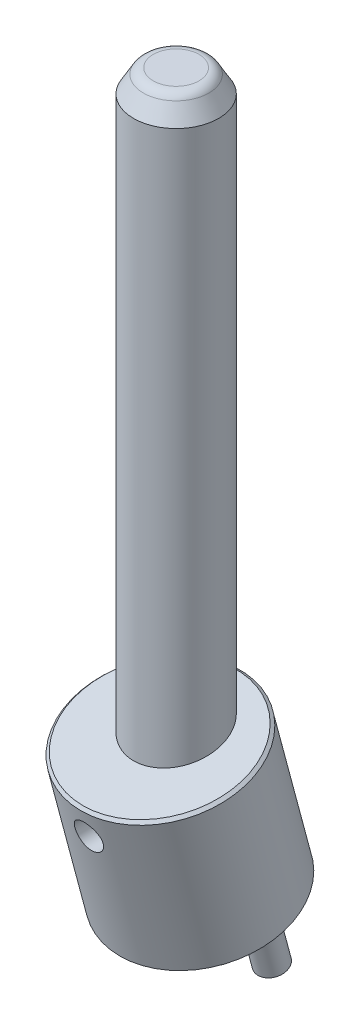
ISO-10303-21;
HEADER;
FILE_DESCRIPTION(('STEP AP214'),'2;1');
FILE_NAME('part.step','',(''),(''),'','','');
FILE_SCHEMA(('AUTOMOTIVE_DESIGN { 1 0 10303 214 1 1 1 1 }'));
ENDSEC;
DATA;
#1=APPLICATION_CONTEXT('core data for automotive mechanical design processes');
#2=APPLICATION_PROTOCOL_DEFINITION('international standard','automotive_design',2000,#1);
#3=PRODUCT_CONTEXT('',#1,'mechanical');
#4=PRODUCT('Part','Part','',(#3));
#5=PRODUCT_RELATED_PRODUCT_CATEGORY('part','',(#4));
#6=PRODUCT_DEFINITION_FORMATION('','',#4);
#7=PRODUCT_DEFINITION_CONTEXT('part definition',#1,'design');
#8=PRODUCT_DEFINITION('design','',#6,#7);
#9=PRODUCT_DEFINITION_SHAPE('','',#8);
#10=(LENGTH_UNIT() NAMED_UNIT(*) SI_UNIT(.MILLI.,.METRE.));
#11=(NAMED_UNIT(*) PLANE_ANGLE_UNIT() SI_UNIT($,.RADIAN.));
#12=(NAMED_UNIT(*) SI_UNIT($,.STERADIAN.) SOLID_ANGLE_UNIT());
#13=UNCERTAINTY_MEASURE_WITH_UNIT(LENGTH_MEASURE(1.E-05),#10,'distance_accuracy_value','');
#14=(GEOMETRIC_REPRESENTATION_CONTEXT(3) GLOBAL_UNCERTAINTY_ASSIGNED_CONTEXT((#13)) GLOBAL_UNIT_ASSIGNED_CONTEXT((#10,
#11,#12)) REPRESENTATION_CONTEXT('',''));
#15=CARTESIAN_POINT('',(0.,0.,0.));
#16=DIRECTION('',(0.,0.,1.));
#17=DIRECTION('',(1.,0.,0.));
#18=AXIS2_PLACEMENT_3D('',#15,#16,#17);
#19=CARTESIAN_POINT('',(0.,-24.1677221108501,-12.3217781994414));
#20=DIRECTION('',(0.,-0.965925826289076,-0.258819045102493));
#21=DIRECTION('',(0.,0.258819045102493,-0.965925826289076));
#22=AXIS2_PLACEMENT_3D('',#19,#20,#21);
#23=PLANE('',#22);
#24=CARTESIAN_POINT('',(-21.5,-24.1677221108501,-12.3217781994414));
#25=DIRECTION('',(0.,-0.965925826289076,-0.258819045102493));
#26=DIRECTION('',(0.,0.258819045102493,-0.965925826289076));
#27=AXIS2_PLACEMENT_3D('',#24,#25,#26);
#28=CIRCLE('',#27,4.50000075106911);
#29=CARTESIAN_POINT('',(-21.5,-23.0030362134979,-16.6684451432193));
#30=VERTEX_POINT('',#29);
#31=EDGE_CURVE('P0_E17',#30,#30,#28,.F.);
#32=ORIENTED_EDGE('',*,*,#31,.F.);
#33=EDGE_LOOP('',(#32));
#34=FACE_BOUND('',#33,.T.);
#35=ADVANCED_FACE('P0_F14',(#34),#23,.T.);
#36=CARTESIAN_POINT('',(0.,-24.1677221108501,-12.3217781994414));
#37=DIRECTION('',(0.,-0.965925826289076,-0.258819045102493));
#38=DIRECTION('',(0.,0.258819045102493,-0.965925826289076));
#39=AXIS2_PLACEMENT_3D('',#36,#37,#38);
#40=PLANE('',#39);
#41=CARTESIAN_POINT('',(21.5,-24.1677221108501,-12.3217781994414));
#42=DIRECTION('',(0.,-0.965925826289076,-0.258819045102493));
#43=DIRECTION('',(0.,0.258819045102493,-0.965925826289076));
#44=AXIS2_PLACEMENT_3D('',#41,#42,#43);
#45=CIRCLE('',#44,4.50000075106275);
#46=CARTESIAN_POINT('',(21.5,-23.0030362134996,-16.6684451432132));
#47=VERTEX_POINT('',#46);
#48=EDGE_CURVE('P0_E121',#47,#47,#45,.F.);
#49=ORIENTED_EDGE('',*,*,#48,.F.);
#50=EDGE_LOOP('',(#49));
#51=FACE_BOUND('',#50,.T.);
#52=ADVANCED_FACE('P0_F111',(#51),#40,.T.);
#53=CARTESIAN_POINT('',(0.,-1.62717062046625E-12,-9.59302082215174E-13));
#54=DIRECTION('',(0.,-1.,0.));
#55=DIRECTION('',(0.,0.,-1.));
#56=AXIS2_PLACEMENT_3D('',#53,#54,#55);
#57=PLANE('',#56);
#58=CARTESIAN_POINT('',(0.,-3.64291929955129E-13,-6.07500161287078E-12));
#59=DIRECTION('',(0.,-1.,0.));
#60=DIRECTION('',(0.,0.,-1.));
#61=AXIS2_PLACEMENT_3D('',#58,#59,#60);
#62=CIRCLE('',#61,15.);
#63=CARTESIAN_POINT('',(0.,-3.64291929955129E-13,-15.0000000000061));
#64=VERTEX_POINT('',#63);
#65=EDGE_CURVE('P0_E36',#64,#64,#62,.F.);
#66=ORIENTED_EDGE('',*,*,#65,.T.);
#67=EDGE_LOOP('',(#66));
#68=FACE_BOUND('',#67,.T.);
#69=ADVANCED_FACE('P0_F108',(#68),#57,.F.);
#70=CARTESIAN_POINT('',(-21.5,-23.6847586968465,-12.1923685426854));
#71=DIRECTION('',(0.,0.965925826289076,0.258819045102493));
#72=DIRECTION('',(0.,-0.258819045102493,0.965925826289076));
#73=AXIS2_PLACEMENT_3D('',#70,#71,#72);
#74=CONICAL_SURFACE('',#73,5.00000135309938,0.785398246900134);
#75=CARTESIAN_POINT('',(-21.5,-23.6847573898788,-12.1923681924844));
#76=DIRECTION('',(0.,-0.965925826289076,-0.258819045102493));
#77=DIRECTION('',(0.,0.258819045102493,-0.965925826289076));
#78=AXIS2_PLACEMENT_3D('',#75,#76,#77);
#79=CIRCLE('',#78,5.);
#80=CARTESIAN_POINT('',(-21.5,-22.3906621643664,-17.0219973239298));
#81=VERTEX_POINT('',#80);
#82=EDGE_CURVE('P0_E33',#81,#81,#79,.F.);
#83=ORIENTED_EDGE('',*,*,#82,.F.);
#84=EDGE_LOOP('',(#83));
#85=FACE_BOUND('',#84,.T.);
#86=ORIENTED_EDGE('',*,*,#31,.T.);
#87=EDGE_LOOP('',(#86));
#88=FACE_BOUND('',#87,.T.);
#89=ADVANCED_FACE('P0_F104',(#85,#88),#74,.T.);
#90=CARTESIAN_POINT('',(21.5,-23.6847586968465,-12.1923685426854));
#91=DIRECTION('',(0.,0.965925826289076,0.258819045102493));
#92=DIRECTION('',(0.,-0.258819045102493,0.965925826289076));
#93=AXIS2_PLACEMENT_3D('',#90,#91,#92);
#94=CONICAL_SURFACE('',#93,5.00000135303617,0.785398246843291);
#95=CARTESIAN_POINT('',(21.5,-23.6847573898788,-12.1923681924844));
#96=DIRECTION('',(0.,-0.965925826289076,-0.258819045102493));
#97=DIRECTION('',(0.,0.258819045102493,-0.965925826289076));
#98=AXIS2_PLACEMENT_3D('',#95,#96,#97);
#99=CIRCLE('',#98,5.);
#100=CARTESIAN_POINT('',(21.5,-22.3906621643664,-17.0219973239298));
#101=VERTEX_POINT('',#100);
#102=EDGE_CURVE('P0_E29',#101,#101,#99,.F.);
#103=ORIENTED_EDGE('',*,*,#102,.F.);
#104=EDGE_LOOP('',(#103));
#105=FACE_BOUND('',#104,.T.);
#106=ORIENTED_EDGE('',*,*,#48,.T.);
#107=EDGE_LOOP('',(#106));
#108=FACE_BOUND('',#107,.T.);
#109=ADVANCED_FACE('P0_F99',(#105,#108),#94,.T.);
#110=CARTESIAN_POINT('',(0.,61.8750000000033,-6.0732668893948E-12));
#111=DIRECTION('',(0.,-1.,0.));
#112=DIRECTION('',(0.,0.,-1.));
#113=AXIS2_PLACEMENT_3D('',#110,#111,#112);
#114=CYLINDRICAL_SURFACE('',#113,15.);
#115=CARTESIAN_POINT('',(0.,45.0000000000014,-6.07500161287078E-12));
#116=DIRECTION('',(0.,0.965925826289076,0.258819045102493));
#117=DIRECTION('',(0.,-0.258819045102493,0.965925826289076));
#118=AXIS2_PLACEMENT_3D('',#115,#116,#117);
#119=ELLIPSE('',#118,15.5291427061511,15.);
#120=CARTESIAN_POINT('',(0.,40.980762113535,14.9999999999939));
#121=VERTEX_POINT('',#120);
#122=EDGE_CURVE('P0_E32',#121,#121,#119,.F.);
#123=ORIENTED_EDGE('',*,*,#122,.F.);
#124=EDGE_LOOP('',(#123));
#125=FACE_BOUND('',#124,.T.);
#126=ORIENTED_EDGE('',*,*,#65,.F.);
#127=EDGE_LOOP('',(#126));
#128=FACE_BOUND('',#127,.T.);
#129=CARTESIAN_POINT('',(0.,30.9999999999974,14.9999999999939));
#130=CARTESIAN_POINT('',(-0.136274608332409,30.9999999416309,14.9999999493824));
#131=CARTESIAN_POINT('',(-0.272550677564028,30.9944241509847,14.9981386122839));
#132=CARTESIAN_POINT('',(-0.544142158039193,30.9721706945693,14.9907428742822));
#133=CARTESIAN_POINT('',(-0.679457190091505,30.9554888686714,14.9852070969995));
#134=CARTESIAN_POINT('',(-0.948257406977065,30.9111491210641,14.9706027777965));
#135=CARTESIAN_POINT('',(-1.08174007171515,30.883477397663,14.96152979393));
#136=CARTESIAN_POINT('',(-1.34580155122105,30.8174009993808,14.9400929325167));
#137=CARTESIAN_POINT('',(-1.47637921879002,30.77899216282,14.9277277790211));
#138=CARTESIAN_POINT('',(-1.7333461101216,30.6918928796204,14.9000723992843));
#139=CARTESIAN_POINT('',(-1.85974572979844,30.6432305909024,14.8847901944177));
#140=CARTESIAN_POINT('',(-2.10792399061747,30.5359631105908,14.8516789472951));
#141=CARTESIAN_POINT('',(-2.22970089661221,30.4773542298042,14.8338489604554));
#142=CARTESIAN_POINT('',(-2.58680471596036,30.2873070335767,14.7772227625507));
#143=CARTESIAN_POINT('',(-2.81420620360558,30.141545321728,14.7352562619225));
#144=CARTESIAN_POINT('',(-3.24874257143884,29.8108587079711,14.6457020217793));
#145=CARTESIAN_POINT('',(-3.45501840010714,29.6248491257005,14.5979792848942));
#146=CARTESIAN_POINT('',(-3.8341436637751,29.2211801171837,14.5030192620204));
#147=CARTESIAN_POINT('',(-4.0069839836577,29.0035120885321,14.4557821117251));
#148=CARTESIAN_POINT('',(-4.31912807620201,28.5350726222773,14.3656662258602));
#149=CARTESIAN_POINT('',(-4.45732572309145,28.2835298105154,14.3229516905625));
#150=CARTESIAN_POINT('',(-4.68909399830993,27.7591186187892,14.2487652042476));
#151=CARTESIAN_POINT('',(-4.78267844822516,27.4862568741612,14.2172897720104));
#152=CARTESIAN_POINT('',(-4.91936749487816,26.9366338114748,14.1705651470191));
#153=CARTESIAN_POINT('',(-4.96406724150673,26.6603139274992,14.1548047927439));
#154=CARTESIAN_POINT('',(-5.00670561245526,26.1036813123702,14.1397828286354));
#155=CARTESIAN_POINT('',(-5.00465868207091,25.8233698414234,14.1405161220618));
#156=CARTESIAN_POINT('',(-4.95509941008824,25.2803173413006,14.157950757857));
#157=CARTESIAN_POINT('',(-4.90966912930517,25.0173587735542,14.1739208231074));
#158=CARTESIAN_POINT('',(-4.77803186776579,24.503034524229,14.2188326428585));
#159=CARTESIAN_POINT('',(-4.69181981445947,24.2516702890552,14.2477760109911));
#160=CARTESIAN_POINT('',(-4.47968995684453,23.762927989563,14.3158968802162));
#161=CARTESIAN_POINT('',(-4.3531541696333,23.5258408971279,14.3552319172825));
#162=CARTESIAN_POINT('',(-4.06444611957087,23.0756402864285,14.4396288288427));
#163=CARTESIAN_POINT('',(-3.90226546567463,22.8625324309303,14.4846920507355));
#164=CARTESIAN_POINT('',(-3.53674216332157,22.4545530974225,14.5783642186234));
#165=CARTESIAN_POINT('',(-3.33169626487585,22.2612084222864,14.6270356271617));
#166=CARTESIAN_POINT('',(-3.00176707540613,21.9988448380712,14.6970107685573));
#167=CARTESIAN_POINT('',(-2.88796886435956,21.9159467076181,14.7198467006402));
#168=CARTESIAN_POINT('',(-2.65358317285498,21.7599196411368,14.7638979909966));
#169=CARTESIAN_POINT('',(-2.53299841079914,21.6867868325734,14.7851139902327));
#170=CARTESIAN_POINT('',(-2.2844294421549,21.5500863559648,14.8255663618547));
#171=CARTESIAN_POINT('',(-2.15637801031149,21.4866337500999,14.8447781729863));
#172=CARTESIAN_POINT('',(-1.89503347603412,21.3708247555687,14.8803974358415));
#173=CARTESIAN_POINT('',(-1.76174256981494,21.3184637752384,14.8968060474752));
#174=CARTESIAN_POINT('',(-1.49104566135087,21.2253547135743,14.9263287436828));
#175=CARTESIAN_POINT('',(-1.35364649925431,21.1845884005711,14.9394479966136));
#176=CARTESIAN_POINT('',(-1.07562722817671,21.1149668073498,14.9620340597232));
#177=CARTESIAN_POINT('',(-0.935008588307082,21.0861062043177,14.9715025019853));
#178=CARTESIAN_POINT('',(-0.66233031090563,21.0422867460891,14.9859443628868));
#179=CARTESIAN_POINT('',(-0.530427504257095,21.0264417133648,14.9912035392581));
#180=CARTESIAN_POINT('',(-0.265683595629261,21.0052983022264,14.9982313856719));
#181=CARTESIAN_POINT('',(-0.132842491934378,20.9999999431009,15.0000000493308));
#182=CARTESIAN_POINT('',(0.136274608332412,21.0000000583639,14.9999999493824));
#183=CARTESIAN_POINT('',(0.272550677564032,21.0055758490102,14.9981386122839));
#184=CARTESIAN_POINT('',(0.544142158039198,21.0278293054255,14.9907428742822));
#185=CARTESIAN_POINT('',(0.67945719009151,21.0445111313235,14.9852070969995));
#186=CARTESIAN_POINT('',(0.94825740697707,21.0888508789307,14.9706027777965));
#187=CARTESIAN_POINT('',(1.08174007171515,21.1165226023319,14.96152979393));
#188=CARTESIAN_POINT('',(1.34580155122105,21.182599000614,14.9400929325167));
#189=CARTESIAN_POINT('',(1.47637921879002,21.2210078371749,14.9277277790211));
#190=CARTESIAN_POINT('',(1.7333461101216,21.3081071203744,14.9000723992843));
#191=CARTESIAN_POINT('',(1.85974572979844,21.3567694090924,14.8847901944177));
#192=CARTESIAN_POINT('',(2.10792399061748,21.464036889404,14.8516789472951));
#193=CARTESIAN_POINT('',(2.22970089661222,21.5226457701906,14.8338489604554));
#194=CARTESIAN_POINT('',(2.58680471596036,21.7126929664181,14.7772227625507));
#195=CARTESIAN_POINT('',(2.81420620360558,21.8584546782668,14.7352562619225));
#196=CARTESIAN_POINT('',(3.24874257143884,22.1891412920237,14.6457020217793));
#197=CARTESIAN_POINT('',(3.45501840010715,22.3751508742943,14.5979792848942));
#198=CARTESIAN_POINT('',(3.8341436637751,22.7788198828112,14.5030192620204));
#199=CARTESIAN_POINT('',(4.0069839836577,22.9964879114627,14.4557821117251));
#200=CARTESIAN_POINT('',(4.31912807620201,23.4649273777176,14.3656662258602));
#201=CARTESIAN_POINT('',(4.45732572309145,23.7164701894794,14.3229516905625));
#202=CARTESIAN_POINT('',(4.68909399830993,24.2408813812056,14.2487652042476));
#203=CARTESIAN_POINT('',(4.78267844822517,24.5137431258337,14.2172897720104));
#204=CARTESIAN_POINT('',(4.91936749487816,25.06336618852,14.1705651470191));
#205=CARTESIAN_POINT('',(4.96406724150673,25.3396860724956,14.1548047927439));
#206=CARTESIAN_POINT('',(5.00670561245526,25.8963186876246,14.1397828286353));
#207=CARTESIAN_POINT('',(5.00465868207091,26.1766301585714,14.1405161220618));
#208=CARTESIAN_POINT('',(4.95509941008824,26.7196826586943,14.157950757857));
#209=CARTESIAN_POINT('',(4.90966912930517,26.9826412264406,14.1739208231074));
#210=CARTESIAN_POINT('',(4.77803186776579,27.4969654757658,14.2188326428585));
#211=CARTESIAN_POINT('',(4.69181981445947,27.7483297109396,14.2477760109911));
#212=CARTESIAN_POINT('',(4.47968995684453,28.2370720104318,14.3158968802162));
#213=CARTESIAN_POINT('',(4.35315416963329,28.4741591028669,14.3552319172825));
#214=CARTESIAN_POINT('',(4.06444611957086,28.9243597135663,14.4396288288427));
#215=CARTESIAN_POINT('',(3.90226546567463,29.1374675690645,14.4846920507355));
#216=CARTESIAN_POINT('',(3.53674216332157,29.5454469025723,14.5783642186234));
#217=CARTESIAN_POINT('',(3.33169626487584,29.7387915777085,14.6270356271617));
#218=CARTESIAN_POINT('',(3.00176707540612,30.0011551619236,14.6970107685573));
#219=CARTESIAN_POINT('',(2.88796886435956,30.0840532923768,14.7198467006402));
#220=CARTESIAN_POINT('',(2.65358317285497,30.240080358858,14.7638979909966));
#221=CARTESIAN_POINT('',(2.53299841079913,30.3132131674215,14.7851139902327));
#222=CARTESIAN_POINT('',(2.28442944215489,30.44991364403,14.8255663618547));
#223=CARTESIAN_POINT('',(2.15637801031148,30.5133662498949,14.8447781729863));
#224=CARTESIAN_POINT('',(1.89503347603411,30.6291752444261,14.8803974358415));
#225=CARTESIAN_POINT('',(1.76174256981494,30.6815362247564,14.8968060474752));
#226=CARTESIAN_POINT('',(1.49104566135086,30.7746452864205,14.9263287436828));
#227=CARTESIAN_POINT('',(1.3536464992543,30.8154115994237,14.9394479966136));
#228=CARTESIAN_POINT('',(1.0756272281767,30.885033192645,14.9620340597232));
#229=CARTESIAN_POINT('',(0.935008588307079,30.9138937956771,14.9715025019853));
#230=CARTESIAN_POINT('',(0.662330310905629,30.9577132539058,14.9859443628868));
#231=CARTESIAN_POINT('',(0.530427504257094,30.97355828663,14.9912035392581));
#232=CARTESIAN_POINT('',(0.26568359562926,30.9947016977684,14.9982313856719));
#233=CARTESIAN_POINT('',(0.132842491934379,31.000000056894,15.0000000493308));
#234=CARTESIAN_POINT('',(0.,30.9999999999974,14.9999999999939));
#235=B_SPLINE_CURVE_WITH_KNOTS('',3,(#129,#130,#131,#132,#133,#134,#135,#136,#137,#138,#139,
#140,#141,#142,#143,#144,#145,#146,#147,#148,#149,#150,#151,#152,#153,#154,#155,#156,#157,#158,
#159,#160,#161,#162,#163,#164,#165,#166,#167,#168,#169,#170,#171,#172,#173,#174,#175,#176,#177,
#178,#179,#180,#181,#182,#183,#184,#185,#186,#187,#188,#189,#190,#191,#192,#193,#194,#195,#196,
#197,#198,#199,#200,#201,#202,#203,#204,#205,#206,#207,#208,#209,#210,#211,#212,#213,#214,#215,
#216,#217,#218,#219,#220,#221,#222,#223,#224,#225,#226,#227,#228,#229,#230,#231,#232,#233,#234),
.UNSPECIFIED.,.T.,.F.,(4,2,2,2,2,2,2,2,2,2,2,2,2,2,2,2,2,2,2,2,2,2,2,2,2,2,2,2,2,2,2,2,2,2,2,2,
2,2,2,2,2,2,2,2,2,2,2,2,2,2,2,2,4),(0.,0.408700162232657,0.81755350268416,1.22692193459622,
1.63644925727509,2.04486626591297,2.45343508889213,3.26962321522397,4.11140352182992,
4.9534129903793,5.81961254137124,6.68554356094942,7.52228757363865,8.3587730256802,
9.15703078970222,9.95538786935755,10.7666215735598,11.5780464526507,12.4317109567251,
12.8591940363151,13.286507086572,13.7185586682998,14.150431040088,14.5816205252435,
15.0126170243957,15.4110232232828,15.8094301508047,16.2181303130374,16.6269836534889,
17.0363520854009,17.4458794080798,17.8542964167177,18.2628652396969,19.0790533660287,
19.9208336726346,20.762843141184,21.629042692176,22.4949737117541,23.3317177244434,
24.1682031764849,24.9664609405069,25.7648180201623,26.5760517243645,27.3874766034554,
28.2411411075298,28.6686241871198,29.0959372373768,29.5279888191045,29.9598611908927,
30.3910506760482,30.8220471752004,31.2204533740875,31.6188603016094),.UNSPECIFIED.);
#236=CARTESIAN_POINT('',(0.,30.9999999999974,14.9999999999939));
#237=VERTEX_POINT('',#236);
#238=EDGE_CURVE('P0_E84',#237,#237,#235,.T.);
#239=ORIENTED_EDGE('',*,*,#238,.T.);
#240=EDGE_LOOP('',(#239));
#241=FACE_BOUND('',#240,.T.);
#242=ADVANCED_FACE('P0_F93',(#125,#128,#241),#114,.F.);
#243=CARTESIAN_POINT('',(-21.5,-9.678834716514,-8.439492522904));
#244=DIRECTION('',(0.,-0.965925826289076,-0.258819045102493));
#245=DIRECTION('',(0.,0.258819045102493,-0.965925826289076));
#246=AXIS2_PLACEMENT_3D('',#243,#244,#245);
#247=CYLINDRICAL_SURFACE('',#246,5.);
#248=CARTESIAN_POINT('',(-21.5,-9.678834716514,-8.439492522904));
#249=DIRECTION('',(0.,-0.965925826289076,-0.258819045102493));
#250=DIRECTION('',(0.,0.258819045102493,-0.965925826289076));
#251=AXIS2_PLACEMENT_3D('',#248,#249,#250);
#252=CIRCLE('',#251,5.);
#253=CARTESIAN_POINT('',(-21.5,-8.38473949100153,-13.2691216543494));
#254=VERTEX_POINT('',#253);
#255=EDGE_CURVE('P0_E80',#254,#254,#252,.T.);
#256=ORIENTED_EDGE('',*,*,#255,.T.);
#257=EDGE_LOOP('',(#256));
#258=FACE_BOUND('',#257,.T.);
#259=ORIENTED_EDGE('',*,*,#82,.T.);
#260=EDGE_LOOP('',(#259));
#261=FACE_BOUND('',#260,.T.);
#262=ADVANCED_FACE('P0_F98',(#258,#261),#247,.T.);
#263=CARTESIAN_POINT('',(21.5,-9.678834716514,-8.439492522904));
#264=DIRECTION('',(0.,-0.965925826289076,-0.258819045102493));
#265=DIRECTION('',(0.,0.258819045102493,-0.965925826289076));
#266=AXIS2_PLACEMENT_3D('',#263,#264,#265);
#267=CYLINDRICAL_SURFACE('',#266,5.);
#268=CARTESIAN_POINT('',(21.5,-9.678834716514,-8.439492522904));
#269=DIRECTION('',(0.,-0.965925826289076,-0.258819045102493));
#270=DIRECTION('',(0.,0.258819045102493,-0.965925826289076));
#271=AXIS2_PLACEMENT_3D('',#268,#269,#270);
#272=CIRCLE('',#271,5.);
#273=CARTESIAN_POINT('',(21.5,-8.38473949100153,-13.2691216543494));
#274=VERTEX_POINT('',#273);
#275=EDGE_CURVE('P0_E76',#274,#274,#272,.T.);
#276=ORIENTED_EDGE('',*,*,#275,.T.);
#277=EDGE_LOOP('',(#276));
#278=FACE_BOUND('',#277,.T.);
#279=ORIENTED_EDGE('',*,*,#102,.T.);
#280=EDGE_LOOP('',(#279));
#281=FACE_BOUND('',#280,.T.);
#282=ADVANCED_FACE('P0_F178',(#278,#281),#267,.T.);
#283=CARTESIAN_POINT('',(0.,43.4470857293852,5.79555495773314));
#284=DIRECTION('',(0.,0.965925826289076,0.258819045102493));
#285=DIRECTION('',(0.,-0.258819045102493,0.965925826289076));
#286=AXIS2_PLACEMENT_3D('',#283,#284,#285);
#287=PLANE('',#286);
#288=ORIENTED_EDGE('',*,*,#122,.T.);
#289=EDGE_LOOP('',(#288));
#290=FACE_BOUND('',#289,.T.);
#291=CARTESIAN_POINT('',(0.,43.4470857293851,5.79555495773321));
#292=DIRECTION('',(0.,0.965925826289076,0.258819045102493));
#293=DIRECTION('',(0.,-0.258819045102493,0.965925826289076));
#294=AXIS2_PLACEMENT_3D('',#291,#292,#293);
#295=CIRCLE('',#294,27.9999945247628);
#296=CARTESIAN_POINT('',(0.,36.200153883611,32.8414728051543));
#297=VERTEX_POINT('',#296);
#298=EDGE_CURVE('P0_E46',#297,#297,#295,.F.);
#299=ORIENTED_EDGE('',*,*,#298,.F.);
#300=EDGE_LOOP('',(#299));
#301=FACE_BOUND('',#300,.T.);
#302=ADVANCED_FACE('P0_F71',(#290,#301),#287,.T.);
#303=CARTESIAN_POINT('',(0.,25.9999999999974,-7.09102540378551));
#304=DIRECTION('',(0.,0.,1.));
#305=DIRECTION('',(0.,-1.,0.));
#306=AXIS2_PLACEMENT_3D('',#303,#304,#305);
#307=CYLINDRICAL_SURFACE('',#306,5.);
#308=ORIENTED_EDGE('',*,*,#238,.F.);
#309=EDGE_LOOP('',(#308));
#310=FACE_BOUND('',#309,.T.);
#311=CARTESIAN_POINT('',(0.,20.9999999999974,29.8038856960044));
#312=CARTESIAN_POINT('',(-0.13972339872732,21.0000005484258,29.8038855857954));
#313=CARTESIAN_POINT('',(-0.279460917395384,21.0058611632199,29.8044081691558));
#314=CARTESIAN_POINT('',(-0.557998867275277,21.0292674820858,29.806516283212));
#315=CARTESIAN_POINT('',(-0.696798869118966,21.0468182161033,29.8081022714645));
#316=CARTESIAN_POINT('',(-0.972634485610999,21.0935168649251,29.8123931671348));
#317=CARTESIAN_POINT('',(-1.10966711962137,21.1226822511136,29.8150997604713));
#318=CARTESIAN_POINT('',(-1.38082596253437,21.1924096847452,29.8217181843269));
#319=CARTESIAN_POINT('',(-1.51495106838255,21.2329759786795,29.8256304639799));
#320=CARTESIAN_POINT('',(-1.77914869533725,21.325154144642,29.8347694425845));
#321=CARTESIAN_POINT('',(-1.90922526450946,21.3767545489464,29.8399947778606));
#322=CARTESIAN_POINT('',(-2.16459019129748,21.4906648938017,29.8519021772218));
#323=CARTESIAN_POINT('',(-2.28987676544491,21.5529787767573,29.8585847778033));
#324=CARTESIAN_POINT('',(-2.53461764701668,21.687783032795,29.8735559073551));
#325=CARTESIAN_POINT('',(-2.6540765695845,21.7602651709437,29.8818431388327));
#326=CARTESIAN_POINT('',(-2.88646225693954,21.9149267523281,29.9001971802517));
#327=CARTESIAN_POINT('',(-2.99938660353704,21.997109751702,29.9102646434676));
#328=CARTESIAN_POINT('',(-3.21766362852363,22.1703755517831,29.9323274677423));
#329=CARTESIAN_POINT('',(-3.32302914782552,22.2614426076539,29.9443194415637));
#330=CARTESIAN_POINT('',(-3.52570347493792,22.4519353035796,29.9704111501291));
#331=CARTESIAN_POINT('',(-3.62300930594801,22.5513640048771,29.9845116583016));
#332=CARTESIAN_POINT('',(-3.80881768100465,22.7577505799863,30.0149594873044));
#333=CARTESIAN_POINT('',(-3.89732320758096,22.8647058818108,30.0313060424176));
#334=CARTESIAN_POINT('',(-4.06500511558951,23.0853910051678,30.0663791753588));
#335=CARTESIAN_POINT('',(-4.14417804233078,23.1991233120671,30.0851066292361));
#336=CARTESIAN_POINT('',(-4.29260666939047,23.4323886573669,30.1250172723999));
#337=CARTESIAN_POINT('',(-4.3618676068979,23.5519185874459,30.1461991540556));
#338=CARTESIAN_POINT('',(-4.49012594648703,23.795962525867,30.191084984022));
#339=CARTESIAN_POINT('',(-4.54911959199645,23.9204783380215,30.2147898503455));
#340=CARTESIAN_POINT('',(-4.65646769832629,24.1734798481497,30.2647162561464));
#341=CARTESIAN_POINT('',(-4.70482596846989,24.3019641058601,30.2909368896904));
#342=CARTESIAN_POINT('',(-4.7907144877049,24.5620015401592,30.345856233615));
#343=CARTESIAN_POINT('',(-4.82824067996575,24.6935558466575,30.3745558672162));
#344=CARTESIAN_POINT('',(-4.9251640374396,25.0949878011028,30.4650671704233));
#345=CARTESIAN_POINT('',(-4.96751571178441,25.3683436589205,30.5306487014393));
#346=CARTESIAN_POINT('',(-5.00684198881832,25.9159828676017,30.670278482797));
#347=CARTESIAN_POINT('',(-5.00380830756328,26.1902663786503,30.7443282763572));
#348=CARTESIAN_POINT('',(-4.9525769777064,26.7427318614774,30.9016043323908));
#349=CARTESIAN_POINT('',(-4.90275255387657,27.0206970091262,30.9850653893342));
#350=CARTESIAN_POINT('',(-4.75763334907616,27.5632813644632,31.1558257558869));
#351=CARTESIAN_POINT('',(-4.66232603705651,27.8278968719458,31.2431261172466));
#352=CARTESIAN_POINT('',(-4.42417180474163,28.3477094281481,31.4215393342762));
#353=CARTESIAN_POINT('',(-4.27955964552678,28.6020939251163,31.5126637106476));
#354=CARTESIAN_POINT('',(-3.94726004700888,29.0829247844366,31.6907915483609));
#355=CARTESIAN_POINT('',(-3.75956927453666,29.3093689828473,31.7777946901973));
#356=CARTESIAN_POINT('',(-3.44904009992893,29.6229690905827,31.9015067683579));
#357=CARTESIAN_POINT('',(-3.34053366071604,29.7232746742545,31.9416611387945));
#358=CARTESIAN_POINT('',(-3.11446793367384,29.9143266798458,32.0190627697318));
#359=CARTESIAN_POINT('',(-2.99691245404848,30.0050770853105,32.0563112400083));
#360=CARTESIAN_POINT('',(-2.75341819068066,30.1762246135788,32.1272865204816));
#361=CARTESIAN_POINT('',(-2.62747584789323,30.2566172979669,32.1610118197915));
#362=CARTESIAN_POINT('',(-2.36810773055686,30.4061850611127,32.2243018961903));
#363=CARTESIAN_POINT('',(-2.23468277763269,30.4753613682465,32.2538671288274));
#364=CARTESIAN_POINT('',(-1.96949551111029,30.5979492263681,32.3066285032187));
#365=CARTESIAN_POINT('',(-1.83810850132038,30.6520548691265,32.330099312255));
#366=CARTESIAN_POINT('',(-1.57054560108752,30.7490661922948,32.3724006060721));
#367=CARTESIAN_POINT('',(-1.43437028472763,30.7919732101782,32.3912316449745));
#368=CARTESIAN_POINT('',(-1.1586344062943,30.8659938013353,32.4238387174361));
#369=CARTESIAN_POINT('',(-1.01908324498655,30.8971368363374,32.4376273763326));
#370=CARTESIAN_POINT('',(-0.737481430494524,30.9473784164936,32.4599219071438));
#371=CARTESIAN_POINT('',(-0.595432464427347,30.9664847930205,32.4684312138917));
#372=CARTESIAN_POINT('',(-0.377537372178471,30.9862989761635,32.4772634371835));
#373=CARTESIAN_POINT('',(-0.302144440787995,30.9914345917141,32.4795547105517));
#374=CARTESIAN_POINT('',(-0.15117081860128,30.99828538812,32.4826119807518));
#375=CARTESIAN_POINT('',(-0.0755901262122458,31.0000005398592,32.4833779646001));
#376=CARTESIAN_POINT('',(0.132241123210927,30.9999990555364,32.4833770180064));
#377=CARTESIAN_POINT('',(0.26451111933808,30.9947471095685,32.4810310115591));
#378=CARTESIAN_POINT('',(0.528109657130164,30.9737910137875,32.47168680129));
#379=CARTESIAN_POINT('',(0.659437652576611,30.9580812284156,32.4646860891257));
#380=CARTESIAN_POINT('',(0.920360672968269,30.9163421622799,32.4461426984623));
#381=CARTESIAN_POINT('',(1.04995219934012,30.8902945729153,32.4345919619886));
#382=CARTESIAN_POINT('',(1.30628180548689,30.8281498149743,32.4071511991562));
#383=CARTESIAN_POINT('',(1.43301871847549,30.7920486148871,32.3912594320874));
#384=CARTESIAN_POINT('',(1.68229560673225,30.7103098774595,32.355473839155));
#385=CARTESIAN_POINT('',(1.80484882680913,30.6647064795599,32.3355943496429));
#386=CARTESIAN_POINT('',(2.04547386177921,30.5643246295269,32.2921243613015));
#387=CARTESIAN_POINT('',(2.16354398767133,30.509542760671,32.2685324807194));
#388=CARTESIAN_POINT('',(2.5097906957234,30.3322099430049,32.1927542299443));
#389=CARTESIAN_POINT('',(2.7303310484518,30.1965633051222,32.1355169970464));
#390=CARTESIAN_POINT('',(3.15497128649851,29.8881970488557,32.0081261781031));
#391=CARTESIAN_POINT('',(3.35794293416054,29.7141244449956,31.9375199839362));
#392=CARTESIAN_POINT('',(3.73244900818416,29.3375662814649,31.788867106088));
#393=CARTESIAN_POINT('',(3.90397056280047,29.1350691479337,31.710817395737));
#394=CARTESIAN_POINT('',(4.22430277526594,28.6900140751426,31.5446989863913));
#395=CARTESIAN_POINT('',(4.37033093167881,28.4455690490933,31.4563222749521));
#396=CARTESIAN_POINT('',(4.61895193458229,27.9353890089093,31.2792437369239));
#397=CARTESIAN_POINT('',(4.72153343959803,27.6696484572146,31.1905418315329));
#398=CARTESIAN_POINT('',(4.84207312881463,27.2554218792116,31.0585970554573));
#399=CARTESIAN_POINT('',(4.8769949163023,27.1120857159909,31.0140299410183));
#400=CARTESIAN_POINT('',(4.9340905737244,26.8224947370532,30.9262901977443));
#401=CARTESIAN_POINT('',(4.95626920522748,26.6762410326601,30.8831170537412));
#402=CARTESIAN_POINT('',(4.98760238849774,26.3817843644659,30.7985724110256));
#403=CARTESIAN_POINT('',(4.99675272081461,26.2335807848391,30.7572015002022));
#404=CARTESIAN_POINT('',(5.00180228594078,25.9364127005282,30.6766607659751));
#405=CARTESIAN_POINT('',(4.99770727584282,25.7874485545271,30.6374899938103));
#406=CARTESIAN_POINT('',(4.9763716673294,25.4929966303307,30.5624475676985));
#407=CARTESIAN_POINT('',(4.95941068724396,25.3475019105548,30.5265236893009));
#408=CARTESIAN_POINT('',(4.91265168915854,25.0580124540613,30.4573167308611));
#409=CARTESIAN_POINT('',(4.88285887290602,24.9140171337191,30.424032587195));
#410=CARTESIAN_POINT('',(4.81051141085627,24.6286321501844,30.3602601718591));
#411=CARTESIAN_POINT('',(4.76795664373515,24.4872425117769,30.3297719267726));
#412=CARTESIAN_POINT('',(4.67028030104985,24.2082630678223,30.2716972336));
#413=CARTESIAN_POINT('',(4.61515948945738,24.0706730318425,30.2441106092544));
#414=CARTESIAN_POINT('',(4.49533539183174,23.8063517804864,30.1930104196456));
#415=CARTESIAN_POINT('',(4.43115260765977,23.6794085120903,30.1693719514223));
#416=CARTESIAN_POINT('',(4.29197465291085,23.4311077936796,30.124759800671));
#417=CARTESIAN_POINT('',(4.21698000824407,23.3097500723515,30.1037859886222));
#418=CARTESIAN_POINT('',(4.05667114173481,23.0736053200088,30.0644303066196));
#419=CARTESIAN_POINT('',(3.97135677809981,22.9588183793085,30.046048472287));
#420=CARTESIAN_POINT('',(3.79103909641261,22.7368013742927,30.0117697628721));
#421=CARTESIAN_POINT('',(3.69603961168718,22.6295683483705,29.9958719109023));
#422=CARTESIAN_POINT('',(3.49959428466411,22.4261630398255,29.966787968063));
#423=CARTESIAN_POINT('',(3.39837940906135,22.3297760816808,29.9535422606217));
#424=CARTESIAN_POINT('',(3.18813345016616,22.1457406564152,29.9291086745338));
#425=CARTESIAN_POINT('',(3.07910544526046,22.0580887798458,29.9179199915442));
#426=CARTESIAN_POINT('',(2.85388687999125,21.8920912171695,29.8974180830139));
#427=CARTESIAN_POINT('',(2.73769092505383,21.8137526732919,29.888106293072));
#428=CARTESIAN_POINT('',(2.49908649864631,21.6670829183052,29.8712008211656));
#429=CARTESIAN_POINT('',(2.37668032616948,21.5987480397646,29.8636065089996));
#430=CARTESIAN_POINT('',(2.12696855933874,21.4728060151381,29.8499929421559));
#431=CARTESIAN_POINT('',(1.99968328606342,21.4151592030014,29.8439678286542));
#432=CARTESIAN_POINT('',(1.74073326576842,21.3107217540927,29.83330841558));
#433=CARTESIAN_POINT('',(1.60907018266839,21.263927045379,29.8286735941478));
#434=CARTESIAN_POINT('',(1.34245723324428,21.1815721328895,29.8206700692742));
#435=CARTESIAN_POINT('',(1.20751258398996,21.1459952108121,29.8172994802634));
#436=CARTESIAN_POINT('',(0.935150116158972,21.0862518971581,29.8117145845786));
#437=CARTESIAN_POINT('',(0.797733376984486,21.0620806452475,29.8094997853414));
#438=CARTESIAN_POINT('',(0.550270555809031,21.0291488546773,29.8065043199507));
#439=CARTESIAN_POINT('',(0.440509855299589,21.0182227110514,29.8055206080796));
#440=CARTESIAN_POINT('',(0.220502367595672,21.003648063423,29.8042113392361));
#441=CARTESIAN_POINT('',(0.1102555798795,20.9999995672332,29.8038857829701));
#442=CARTESIAN_POINT('',(0.,20.9999999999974,29.8038856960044));
#443=B_SPLINE_CURVE_WITH_KNOTS('',3,(#311,#312,#313,#314,#315,#316,#317,#318,#319,#320,#321,
#322,#323,#324,#325,#326,#327,#328,#329,#330,#331,#332,#333,#334,#335,#336,#337,#338,#339,#340,
#341,#342,#343,#344,#345,#346,#347,#348,#349,#350,#351,#352,#353,#354,#355,#356,#357,#358,#359,
#360,#361,#362,#363,#364,#365,#366,#367,#368,#369,#370,#371,#372,#373,#374,#375,#376,#377,#378,
#379,#380,#381,#382,#383,#384,#385,#386,#387,#388,#389,#390,#391,#392,#393,#394,#395,#396,#397,
#398,#399,#400,#401,#402,#403,#404,#405,#406,#407,#408,#409,#410,#411,#412,#413,#414,#415,#416,
#417,#418,#419,#420,#421,#422,#423,#424,#425,#426,#427,#428,#429,#430,#431,#432,#433,#434,#435,
#436,#437,#438,#439,#440,#441,#442),.UNSPECIFIED.,.T.,.F.,(4,2,2,2,2,2,2,2,2,2,2,2,2,2,2,2,2,2,
2,2,2,2,2,2,2,2,2,2,2,2,2,2,2,2,2,2,2,2,2,2,2,2,2,2,2,2,2,2,2,2,2,2,2,2,2,2,2,2,2,2,2,2,2,2,2,
4),(0.,0.41907102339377,0.838322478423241,1.25820699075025,1.67824810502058,2.09785477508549,
2.51761618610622,2.93703958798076,3.35661722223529,3.7754643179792,4.19446542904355,
4.61332404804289,5.03233723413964,5.45112820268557,5.87007207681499,6.28886565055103,
6.70781586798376,7.55647362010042,8.40528627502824,9.28474691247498,10.1644499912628,
11.0796973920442,11.9950156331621,12.4539033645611,12.9125990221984,13.371490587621,
13.8303318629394,14.2618116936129,14.6932399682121,15.1235804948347,15.5536407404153,
15.7803666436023,16.0070944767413,16.4037434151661,16.8006062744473,17.19817515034,
17.5959036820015,17.9922271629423,18.3886985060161,19.1806086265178,20.0068725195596,
20.8334738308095,21.7240059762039,22.6147704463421,23.0766444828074,23.5383458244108,
24.0001966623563,24.4618467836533,24.9137414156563,25.3654530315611,25.8171689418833,
26.2688573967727,26.7009174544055,27.1329565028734,27.5650014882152,27.9968761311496,
28.4175546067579,28.8380682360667,29.2589022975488,29.6795816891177,30.0986671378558,
30.5175950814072,30.9358956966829,31.3540178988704,31.6847060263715,32.0153945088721),.UNSPECIFIED.);
#444=CARTESIAN_POINT('',(0.,20.9999999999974,29.8038856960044));
#445=VERTEX_POINT('',#444);
#446=EDGE_CURVE('P0_E39',#445,#445,#443,.T.);
#447=ORIENTED_EDGE('',*,*,#446,.F.);
#448=EDGE_LOOP('',(#447));
#449=FACE_BOUND('',#448,.T.);
#450=ADVANCED_FACE('P0_F48',(#310,#449),#307,.F.);
#451=CARTESIAN_POINT('',(0.,-9.678834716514,-8.439492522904));
#452=DIRECTION('',(0.,0.965925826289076,0.258819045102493));
#453=DIRECTION('',(0.,-0.258819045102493,0.965925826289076));
#454=AXIS2_PLACEMENT_3D('',#451,#452,#453);
#455=PLANE('',#454);
#456=ORIENTED_EDGE('',*,*,#275,.F.);
#457=EDGE_LOOP('',(#456));
#458=FACE_BOUND('',#457,.T.);
#459=ORIENTED_EDGE('',*,*,#255,.F.);
#460=EDGE_LOOP('',(#459));
#461=FACE_BOUND('',#460,.T.);
#462=CARTESIAN_POINT('',(-1.28369537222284E-13,-9.67883471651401,-8.43949252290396));
#463=DIRECTION('',(0.,0.965925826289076,0.258819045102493));
#464=DIRECTION('',(0.,-0.258819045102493,0.965925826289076));
#465=AXIS2_PLACEMENT_3D('',#462,#463,#464);
#466=CIRCLE('',#465,27.9999942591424);
#467=CARTESIAN_POINT('',(-1.28369537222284E-13,-16.9257664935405,18.6064250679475));
#468=VERTEX_POINT('',#467);
#469=EDGE_CURVE('P0_E26',#468,#468,#466,.T.);
#470=ORIENTED_EDGE('',*,*,#469,.F.);
#471=EDGE_LOOP('',(#470));
#472=FACE_BOUND('',#471,.T.);
#473=ADVANCED_FACE('P0_F63',(#458,#461,#472),#455,.F.);
#474=CARTESIAN_POINT('',(0.,42.4811570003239,5.53673513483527));
#475=DIRECTION('',(0.,-0.965925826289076,-0.258819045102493));
#476=DIRECTION('',(0.,0.258819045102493,-0.965925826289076));
#477=AXIS2_PLACEMENT_3D('',#474,#475,#476);
#478=CONICAL_SURFACE('',#477,28.9999973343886,0.785398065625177);
#479=ORIENTED_EDGE('',*,*,#298,.T.);
#480=EDGE_LOOP('',(#479));
#481=FACE_BOUND('',#480,.T.);
#482=CARTESIAN_POINT('',(0.,42.4811595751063,5.53673582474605));
#483=DIRECTION('',(0.,0.965925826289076,0.258819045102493));
#484=DIRECTION('',(0.,-0.258819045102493,0.965925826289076));
#485=AXIS2_PLACEMENT_3D('',#482,#483,#484);
#486=CIRCLE('',#485,29.);
#487=CARTESIAN_POINT('',(0.,34.975407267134,33.5485847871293));
#488=VERTEX_POINT('',#487);
#489=EDGE_CURVE('P0_E21',#488,#488,#486,.F.);
#490=ORIENTED_EDGE('',*,*,#489,.F.);
#491=EDGE_LOOP('',(#490));
#492=FACE_BOUND('',#491,.T.);
#493=ADVANCED_FACE('P0_F60',(#481,#492),#478,.T.);
#494=CARTESIAN_POINT('',(-1.28369537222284E-13,-8.71290581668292,-8.18067265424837));
#495=DIRECTION('',(0.,0.965925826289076,0.258819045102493));
#496=DIRECTION('',(0.,-0.258819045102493,0.965925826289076));
#497=AXIS2_PLACEMENT_3D('',#494,#495,#496);
#498=CONICAL_SURFACE('',#497,28.9999972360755,0.785398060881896);
#499=CARTESIAN_POINT('',(0.,-8.71290848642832,-8.18067336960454));
#500=DIRECTION('',(0.,0.965925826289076,0.258819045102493));
#501=DIRECTION('',(0.,-0.258819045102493,0.965925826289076));
#502=AXIS2_PLACEMENT_3D('',#499,#500,#501);
#503=CIRCLE('',#502,29.);
#504=CARTESIAN_POINT('',(0.,-16.2186607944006,19.8311755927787));
#505=VERTEX_POINT('',#504);
#506=EDGE_CURVE('P0_E9',#505,#505,#503,.T.);
#507=ORIENTED_EDGE('',*,*,#506,.F.);
#508=EDGE_LOOP('',(#507));
#509=FACE_BOUND('',#508,.T.);
#510=ORIENTED_EDGE('',*,*,#469,.T.);
#511=EDGE_LOOP('',(#510));
#512=FACE_BOUND('',#511,.T.);
#513=ADVANCED_FACE('P0_F56',(#509,#512),#498,.T.);
#514=CARTESIAN_POINT('',(0.,-12.335130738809,-9.15124489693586));
#515=DIRECTION('',(0.,0.965925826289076,0.258819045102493));
#516=DIRECTION('',(0.,-0.258819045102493,0.965925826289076));
#517=AXIS2_PLACEMENT_3D('',#514,#515,#516);
#518=CYLINDRICAL_SURFACE('',#517,29.);
#519=ORIENTED_EDGE('',*,*,#489,.T.);
#520=EDGE_LOOP('',(#519));
#521=FACE_BOUND('',#520,.T.);
#522=ORIENTED_EDGE('',*,*,#506,.T.);
#523=EDGE_LOOP('',(#522));
#524=FACE_BOUND('',#523,.T.);
#525=ORIENTED_EDGE('',*,*,#446,.T.);
#526=EDGE_LOOP('',(#525));
#527=FACE_BOUND('',#526,.T.);
#528=ADVANCED_FACE('P0_F52',(#521,#524,#527),#518,.T.);
#529=CLOSED_SHELL('',(#35,#52,#69,#89,#109,#242,#262,#282,#302,#450,#473,#493,#513,#528));
#530=MANIFOLD_SOLID_BREP('P0_B1',#529);
#531=CARTESIAN_POINT('',(0.,245.,0.));
#532=DIRECTION('',(0.,1.,0.));
#533=DIRECTION('',(-1.,0.,0.));
#534=AXIS2_PLACEMENT_3D('',#531,#532,#533);
#535=PLANE('',#534);
#536=CARTESIAN_POINT('',(0.,245.,0.));
#537=DIRECTION('',(0.,-1.,0.));
#538=DIRECTION('',(0.,0.,-1.));
#539=AXIS2_PLACEMENT_3D('',#536,#537,#538);
#540=CIRCLE('',#539,8.071796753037);
#541=CARTESIAN_POINT('',(0.,245.,-8.0717967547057));
#542=VERTEX_POINT('',#541);
#543=CARTESIAN_POINT('',(0.,245.,8.0717967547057));
#544=VERTEX_POINT('',#543);
#545=EDGE_CURVE('P1_E38',#542,#544,#540,.T.);
#546=ORIENTED_EDGE('',*,*,#545,.F.);
#547=CARTESIAN_POINT('',(0.,245.,0.));
#548=DIRECTION('',(0.,-1.,0.));
#549=DIRECTION('',(0.,0.,1.));
#550=AXIS2_PLACEMENT_3D('',#547,#548,#549);
#551=CIRCLE('',#550,8.071796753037);
#552=EDGE_CURVE('P1_E42',#544,#542,#551,.T.);
#553=ORIENTED_EDGE('',*,*,#552,.F.);
#554=EDGE_LOOP('',(#546,#553));
#555=FACE_BOUND('',#554,.T.);
#556=ADVANCED_FACE('P1_F17',(#555),#535,.T.);
#557=CARTESIAN_POINT('',(0.,241.,0.));
#558=DIRECTION('',(0.,1.,0.));
#559=DIRECTION('',(0.0058252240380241,0.,0.999983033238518));
#560=AXIS2_PLACEMENT_3D('',#557,#558,#559);
#561=TOROIDAL_SURFACE('',#560,8.071796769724,4.);
#562=ORIENTED_EDGE('',*,*,#545,.T.);
#563=ORIENTED_EDGE('',*,*,#552,.T.);
#564=EDGE_LOOP('',(#562,#563));
#565=FACE_BOUND('',#564,.T.);
#566=CARTESIAN_POINT('',(0.,243.0000000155,0.));
#567=DIRECTION('',(0.,-1.,0.));
#568=DIRECTION('',(0.,0.,1.));
#569=AXIS2_PLACEMENT_3D('',#566,#567,#568);
#570=CIRCLE('',#569,11.5358983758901);
#571=CARTESIAN_POINT('',(0.,243.0000000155,11.5358983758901));
#572=VERTEX_POINT('',#571);
#573=EDGE_CURVE('P1_E48',#572,#572,#570,.T.);
#574=ORIENTED_EDGE('',*,*,#573,.F.);
#575=EDGE_LOOP('',(#574));
#576=FACE_BOUND('',#575,.T.);
#577=ADVANCED_FACE('P1_F40',(#565,#576),#561,.T.);
#578=CARTESIAN_POINT('',(0.,0.,0.));
#579=DIRECTION('',(0.,1.,0.));
#580=DIRECTION('',(-1.,0.,0.));
#581=AXIS2_PLACEMENT_3D('',#578,#579,#580);
#582=PLANE('',#581);
#583=CARTESIAN_POINT('',(0.,0.,0.));
#584=DIRECTION('',(0.,1.,0.));
#585=DIRECTION('',(-1.,0.,0.));
#586=AXIS2_PLACEMENT_3D('',#583,#584,#585);
#587=CIRCLE('',#586,13.9999960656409);
#588=CARTESIAN_POINT('',(-13.9999960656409,0.,0.));
#589=VERTEX_POINT('',#588);
#590=EDGE_CURVE('P1_E85',#589,#589,#587,.T.);
#591=ORIENTED_EDGE('',*,*,#590,.F.);
#592=EDGE_LOOP('',(#591));
#593=FACE_BOUND('',#592,.T.);
#594=ADVANCED_FACE('P1_F76',(#593),#582,.F.);
#595=CARTESIAN_POINT('',(0.,26.,4.88675134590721));
#596=DIRECTION('',(0.,0.,1.));
#597=DIRECTION('',(0.,-1.,0.));
#598=AXIS2_PLACEMENT_3D('',#595,#596,#597);
#599=CONICAL_SURFACE('',#598,4.99999999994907,1.04719755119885);
#600=CARTESIAN_POINT('',(0.,26.0000000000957,1.99999999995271));
#601=VERTEX_POINT('',#600);
#602=VERTEX_LOOP('',#601);
#603=FACE_BOUND('',#602,.T.);
#604=CARTESIAN_POINT('',(0.,26.,4.886751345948));
#605=DIRECTION('',(0.,0.,1.));
#606=DIRECTION('',(0.,-1.,0.));
#607=AXIS2_PLACEMENT_3D('',#604,#605,#606);
#608=CIRCLE('',#607,5.);
#609=CARTESIAN_POINT('',(0.,21.,4.886751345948));
#610=VERTEX_POINT('',#609);
#611=EDGE_CURVE('P1_E82',#610,#610,#608,.T.);
#612=ORIENTED_EDGE('',*,*,#611,.T.);
#613=EDGE_LOOP('',(#612));
#614=FACE_BOUND('',#613,.T.);
#615=ADVANCED_FACE('P1_F116',(#603,#614),#599,.F.);
#616=CARTESIAN_POINT('',(0.,236.99999999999,0.));
#617=DIRECTION('',(0.,-1.,0.));
#618=DIRECTION('',(1.,0.,0.));
#619=AXIS2_PLACEMENT_3D('',#616,#617,#618);
#620=CONICAL_SURFACE('',#619,14.999999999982,0.5235987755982);
#621=CARTESIAN_POINT('',(0.,237.,0.));
#622=DIRECTION('',(0.,1.,0.));
#623=DIRECTION('',(-1.,0.,0.));
#624=AXIS2_PLACEMENT_3D('',#621,#622,#623);
#625=CIRCLE('',#624,15.);
#626=CARTESIAN_POINT('',(-15.,237.,0.));
#627=VERTEX_POINT('',#626);
#628=EDGE_CURVE('P1_E92',#627,#627,#625,.F.);
#629=ORIENTED_EDGE('',*,*,#628,.F.);
#630=EDGE_LOOP('',(#629));
#631=FACE_BOUND('',#630,.T.);
#632=ORIENTED_EDGE('',*,*,#573,.T.);
#633=EDGE_LOOP('',(#632));
#634=FACE_BOUND('',#633,.T.);
#635=ADVANCED_FACE('P1_F108',(#631,#634),#620,.T.);
#636=CARTESIAN_POINT('',(0.,1.0000022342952,0.));
#637=DIRECTION('',(0.,1.,0.));
#638=DIRECTION('',(-1.,0.,0.));
#639=AXIS2_PLACEMENT_3D('',#636,#637,#638);
#640=CONICAL_SURFACE('',#639,14.9999980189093,0.785398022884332);
#641=CARTESIAN_POINT('',(0.,1.000000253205,0.));
#642=DIRECTION('',(0.,1.,0.));
#643=DIRECTION('',(-1.,0.,0.));
#644=AXIS2_PLACEMENT_3D('',#641,#642,#643);
#645=CIRCLE('',#644,15.);
#646=CARTESIAN_POINT('',(-15.,1.000000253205,0.));
#647=VERTEX_POINT('',#646);
#648=EDGE_CURVE('P1_E28',#647,#647,#645,.T.);
#649=ORIENTED_EDGE('',*,*,#648,.F.);
#650=EDGE_LOOP('',(#649));
#651=FACE_BOUND('',#650,.T.);
#652=ORIENTED_EDGE('',*,*,#590,.T.);
#653=EDGE_LOOP('',(#652));
#654=FACE_BOUND('',#653,.T.);
#655=ADVANCED_FACE('P1_F105',(#651,#654),#640,.T.);
#656=CARTESIAN_POINT('',(0.,26.,1.25));
#657=DIRECTION('',(0.,0.,1.));
#658=DIRECTION('',(0.,-1.,0.));
#659=AXIS2_PLACEMENT_3D('',#656,#657,#658);
#660=CYLINDRICAL_SURFACE('',#659,5.);
#661=ORIENTED_EDGE('',*,*,#611,.F.);
#662=EDGE_LOOP('',(#661));
#663=FACE_BOUND('',#662,.T.);
#664=CARTESIAN_POINT('',(0.,21.,15.));
#665=CARTESIAN_POINT('',(-0.136274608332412,21.0000000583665,14.9999999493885));
#666=CARTESIAN_POINT('',(-0.272550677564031,21.0055758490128,14.99813861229));
#667=CARTESIAN_POINT('',(-0.544142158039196,21.0278293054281,14.9907428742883));
#668=CARTESIAN_POINT('',(-0.679457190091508,21.044511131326,14.9852070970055));
#669=CARTESIAN_POINT('',(-0.948257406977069,21.0888508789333,14.9706027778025));
#670=CARTESIAN_POINT('',(-1.08174007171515,21.1165226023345,14.9615297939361));
#671=CARTESIAN_POINT('',(-1.34580155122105,21.1825990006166,14.9400929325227));
#672=CARTESIAN_POINT('',(-1.47637921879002,21.2210078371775,14.9277277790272));
#673=CARTESIAN_POINT('',(-1.7333461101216,21.308107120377,14.9000723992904));
#674=CARTESIAN_POINT('',(-1.85974572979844,21.356769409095,14.8847901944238));
#675=CARTESIAN_POINT('',(-2.10792399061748,21.4640368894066,14.8516789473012));
#676=CARTESIAN_POINT('',(-2.22970089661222,21.5226457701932,14.8338489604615));
#677=CARTESIAN_POINT('',(-2.58680471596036,21.7126929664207,14.7772227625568));
#678=CARTESIAN_POINT('',(-2.81420620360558,21.8584546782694,14.7352562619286));
#679=CARTESIAN_POINT('',(-3.24874257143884,22.1891412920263,14.6457020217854));
#680=CARTESIAN_POINT('',(-3.45501840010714,22.3751508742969,14.5979792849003));
#681=CARTESIAN_POINT('',(-3.8341436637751,22.7788198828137,14.5030192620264));
#682=CARTESIAN_POINT('',(-4.0069839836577,22.9964879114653,14.4557821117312));
#683=CARTESIAN_POINT('',(-4.31912807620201,23.4649273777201,14.3656662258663));
#684=CARTESIAN_POINT('',(-4.45732572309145,23.716470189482,14.3229516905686));
#685=CARTESIAN_POINT('',(-4.68909399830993,24.2408813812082,14.2487652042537));
#686=CARTESIAN_POINT('',(-4.78267844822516,24.5137431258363,14.2172897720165));
#687=CARTESIAN_POINT('',(-4.91936749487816,25.0633661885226,14.1705651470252));
#688=CARTESIAN_POINT('',(-4.96406724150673,25.3396860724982,14.15480479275));
#689=CARTESIAN_POINT('',(-5.00670561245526,25.8963186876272,14.1397828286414));
#690=CARTESIAN_POINT('',(-5.00465868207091,26.176630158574,14.1405161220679));
#691=CARTESIAN_POINT('',(-4.95509941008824,26.7196826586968,14.1579507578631));
#692=CARTESIAN_POINT('',(-4.90966912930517,26.9826412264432,14.1739208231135));
#693=CARTESIAN_POINT('',(-4.77803186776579,27.4969654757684,14.2188326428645));
#694=CARTESIAN_POINT('',(-4.69181981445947,27.7483297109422,14.2477760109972));
#695=CARTESIAN_POINT('',(-4.47968995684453,28.2370720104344,14.3158968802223));
#696=CARTESIAN_POINT('',(-4.3531541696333,28.4741591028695,14.3552319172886));
#697=CARTESIAN_POINT('',(-4.06444611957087,28.9243597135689,14.4396288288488));
#698=CARTESIAN_POINT('',(-3.90226546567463,29.1374675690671,14.4846920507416));
#699=CARTESIAN_POINT('',(-3.53674216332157,29.5454469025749,14.5783642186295));
#700=CARTESIAN_POINT('',(-3.33169626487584,29.7387915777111,14.6270356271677));
#701=CARTESIAN_POINT('',(-3.00176707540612,30.0011551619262,14.6970107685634));
#702=CARTESIAN_POINT('',(-2.88796886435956,30.0840532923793,14.7198467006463));
#703=CARTESIAN_POINT('',(-2.65358317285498,30.2400803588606,14.7638979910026));
#704=CARTESIAN_POINT('',(-2.53299841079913,30.3132131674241,14.7851139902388));
#705=CARTESIAN_POINT('',(-2.28442944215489,30.4499136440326,14.8255663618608));
#706=CARTESIAN_POINT('',(-2.15637801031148,30.5133662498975,14.8447781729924));
#707=CARTESIAN_POINT('',(-1.89503347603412,30.6291752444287,14.8803974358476));
#708=CARTESIAN_POINT('',(-1.76174256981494,30.681536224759,14.8968060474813));
#709=CARTESIAN_POINT('',(-1.49104566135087,30.7746452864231,14.9263287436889));
#710=CARTESIAN_POINT('',(-1.3536464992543,30.8154115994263,14.9394479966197));
#711=CARTESIAN_POINT('',(-1.0756272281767,30.8850331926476,14.9620340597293));
#712=CARTESIAN_POINT('',(-0.935008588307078,30.9138937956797,14.9715025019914));
#713=CARTESIAN_POINT('',(-0.662330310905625,30.9577132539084,14.9859443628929));
#714=CARTESIAN_POINT('',(-0.530427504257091,30.9735582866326,14.9912035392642));
#715=CARTESIAN_POINT('',(-0.265683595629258,30.994701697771,14.998231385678));
#716=CARTESIAN_POINT('',(-0.132842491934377,31.0000000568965,15.0000000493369));
#717=CARTESIAN_POINT('',(0.13627460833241,30.9999999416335,14.9999999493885));
#718=CARTESIAN_POINT('',(0.272550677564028,30.9944241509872,14.99813861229));
#719=CARTESIAN_POINT('',(0.544142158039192,30.9721706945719,14.9907428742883));
#720=CARTESIAN_POINT('',(0.679457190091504,30.955488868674,14.9852070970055));
#721=CARTESIAN_POINT('',(0.948257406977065,30.9111491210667,14.9706027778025));
#722=CARTESIAN_POINT('',(1.08174007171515,30.8834773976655,14.9615297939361));
#723=CARTESIAN_POINT('',(1.34580155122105,30.8174009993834,14.9400929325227));
#724=CARTESIAN_POINT('',(1.47637921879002,30.7789921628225,14.9277277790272));
#725=CARTESIAN_POINT('',(1.7333461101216,30.691892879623,14.9000723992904));
#726=CARTESIAN_POINT('',(1.85974572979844,30.643230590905,14.8847901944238));
#727=CARTESIAN_POINT('',(2.10792399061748,30.5359631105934,14.8516789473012));
#728=CARTESIAN_POINT('',(2.22970089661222,30.4773542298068,14.8338489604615));
#729=CARTESIAN_POINT('',(2.58680471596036,30.2873070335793,14.7772227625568));
#730=CARTESIAN_POINT('',(2.81420620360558,30.1415453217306,14.7352562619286));
#731=CARTESIAN_POINT('',(3.24874257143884,29.8108587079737,14.6457020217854));
#732=CARTESIAN_POINT('',(3.45501840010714,29.6248491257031,14.5979792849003));
#733=CARTESIAN_POINT('',(3.8341436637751,29.2211801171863,14.5030192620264));
#734=CARTESIAN_POINT('',(4.0069839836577,29.0035120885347,14.4557821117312));
#735=CARTESIAN_POINT('',(4.31912807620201,28.5350726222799,14.3656662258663));
#736=CARTESIAN_POINT('',(4.45732572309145,28.283529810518,14.3229516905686));
#737=CARTESIAN_POINT('',(4.68909399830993,27.7591186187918,14.2487652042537));
#738=CARTESIAN_POINT('',(4.78267844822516,27.4862568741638,14.2172897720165));
#739=CARTESIAN_POINT('',(4.91936749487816,26.9366338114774,14.1705651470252));
#740=CARTESIAN_POINT('',(4.96406724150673,26.6603139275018,14.15480479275));
#741=CARTESIAN_POINT('',(5.00670561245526,26.1036813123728,14.1397828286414));
#742=CARTESIAN_POINT('',(5.00465868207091,25.823369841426,14.1405161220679));
#743=CARTESIAN_POINT('',(4.95509941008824,25.2803173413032,14.1579507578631));
#744=CARTESIAN_POINT('',(4.90966912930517,25.0173587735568,14.1739208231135));
#745=CARTESIAN_POINT('',(4.77803186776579,24.5030345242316,14.2188326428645));
#746=CARTESIAN_POINT('',(4.69181981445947,24.2516702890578,14.2477760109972));
#747=CARTESIAN_POINT('',(4.47968995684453,23.7629279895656,14.3158968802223));
#748=CARTESIAN_POINT('',(4.35315416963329,23.5258408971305,14.3552319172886));
#749=CARTESIAN_POINT('',(4.06444611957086,23.0756402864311,14.4396288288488));
#750=CARTESIAN_POINT('',(3.90226546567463,22.8625324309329,14.4846920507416));
#751=CARTESIAN_POINT('',(3.53674216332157,22.4545530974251,14.5783642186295));
#752=CARTESIAN_POINT('',(3.33169626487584,22.2612084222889,14.6270356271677));
#753=CARTESIAN_POINT('',(3.00176707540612,21.9988448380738,14.6970107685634));
#754=CARTESIAN_POINT('',(2.88796886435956,21.9159467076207,14.7198467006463));
#755=CARTESIAN_POINT('',(2.65358317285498,21.7599196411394,14.7638979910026));
#756=CARTESIAN_POINT('',(2.53299841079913,21.6867868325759,14.7851139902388));
#757=CARTESIAN_POINT('',(2.28442944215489,21.5500863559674,14.8255663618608));
#758=CARTESIAN_POINT('',(2.15637801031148,21.4866337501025,14.8447781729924));
#759=CARTESIAN_POINT('',(1.89503347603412,21.3708247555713,14.8803974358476));
#760=CARTESIAN_POINT('',(1.76174256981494,21.318463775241,14.8968060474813));
#761=CARTESIAN_POINT('',(1.49104566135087,21.2253547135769,14.9263287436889));
#762=CARTESIAN_POINT('',(1.3536464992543,21.1845884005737,14.9394479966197));
#763=CARTESIAN_POINT('',(1.07562722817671,21.1149668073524,14.9620340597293));
#764=CARTESIAN_POINT('',(0.935008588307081,21.0861062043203,14.9715025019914));
#765=CARTESIAN_POINT('',(0.662330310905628,21.0422867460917,14.9859443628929));
#766=CARTESIAN_POINT('',(0.530427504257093,21.0264417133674,14.9912035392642));
#767=CARTESIAN_POINT('',(0.265683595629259,21.005298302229,14.998231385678));
#768=CARTESIAN_POINT('',(0.132842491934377,20.9999999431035,15.0000000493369));
#769=CARTESIAN_POINT('',(0.,21.,15.));
#770=B_SPLINE_CURVE_WITH_KNOTS('',3,(#664,#665,#666,#667,#668,#669,#670,#671,#672,#673,#674,
#675,#676,#677,#678,#679,#680,#681,#682,#683,#684,#685,#686,#687,#688,#689,#690,#691,#692,#693,
#694,#695,#696,#697,#698,#699,#700,#701,#702,#703,#704,#705,#706,#707,#708,#709,#710,#711,#712,
#713,#714,#715,#716,#717,#718,#719,#720,#721,#722,#723,#724,#725,#726,#727,#728,#729,#730,#731,
#732,#733,#734,#735,#736,#737,#738,#739,#740,#741,#742,#743,#744,#745,#746,#747,#748,#749,#750,
#751,#752,#753,#754,#755,#756,#757,#758,#759,#760,#761,#762,#763,#764,#765,#766,#767,#768,#769),
.UNSPECIFIED.,.T.,.F.,(4,2,2,2,2,2,2,2,2,2,2,2,2,2,2,2,2,2,2,2,2,2,2,2,2,2,2,2,2,2,2,2,2,2,2,2,
2,2,2,2,2,2,2,2,2,2,2,2,2,2,2,2,4),(0.,0.408700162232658,0.817553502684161,1.22692193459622,
1.6364492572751,2.04486626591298,2.45343508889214,3.26962321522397,4.11140352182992,
4.9534129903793,5.81961254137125,6.68554356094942,7.52228757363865,8.3587730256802,
9.15703078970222,9.95538786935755,10.7666215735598,11.5780464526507,12.4317109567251,
12.8591940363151,13.286507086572,13.7185586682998,14.150431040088,14.5816205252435,
15.0126170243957,15.4110232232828,15.8094301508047,16.2181303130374,16.6269836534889,
17.0363520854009,17.4458794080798,17.8542964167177,18.2628652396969,19.0790533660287,
19.9208336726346,20.762843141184,21.629042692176,22.4949737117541,23.3317177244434,
24.1682031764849,24.9664609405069,25.7648180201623,26.5760517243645,27.3874766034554,
28.2411411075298,28.6686241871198,29.0959372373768,29.5279888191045,29.9598611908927,
30.3910506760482,30.8220471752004,31.2204533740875,31.6188603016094),.UNSPECIFIED.);
#771=CARTESIAN_POINT('',(0.,21.,15.));
#772=VERTEX_POINT('',#771);
#773=EDGE_CURVE('P1_E11',#772,#772,#770,.T.);
#774=ORIENTED_EDGE('',*,*,#773,.F.);
#775=EDGE_LOOP('',(#774));
#776=FACE_BOUND('',#775,.T.);
#777=ADVANCED_FACE('P1_F107',(#663,#776),#660,.F.);
#778=CARTESIAN_POINT('',(0.,-12.25,0.));
#779=DIRECTION('',(0.,1.,0.));
#780=DIRECTION('',(-1.,0.,0.));
#781=AXIS2_PLACEMENT_3D('',#778,#779,#780);
#782=CYLINDRICAL_SURFACE('',#781,15.);
#783=ORIENTED_EDGE('',*,*,#628,.T.);
#784=EDGE_LOOP('',(#783));
#785=FACE_BOUND('',#784,.T.);
#786=ORIENTED_EDGE('',*,*,#648,.T.);
#787=EDGE_LOOP('',(#786));
#788=FACE_BOUND('',#787,.T.);
#789=ORIENTED_EDGE('',*,*,#773,.T.);
#790=EDGE_LOOP('',(#789));
#791=FACE_BOUND('',#790,.T.);
#792=ADVANCED_FACE('P1_F102',(#785,#788,#791),#782,.T.);
#793=CLOSED_SHELL('',(#556,#577,#594,#615,#635,#655,#777,#792));
#794=MANIFOLD_SOLID_BREP('P1_B1',#793);
#795=ADVANCED_BREP_SHAPE_REPRESENTATION('',(#18,#530,#794),#14);
#796=SHAPE_DEFINITION_REPRESENTATION(#9,#795);
ENDSEC;
END-ISO-10303-21;
